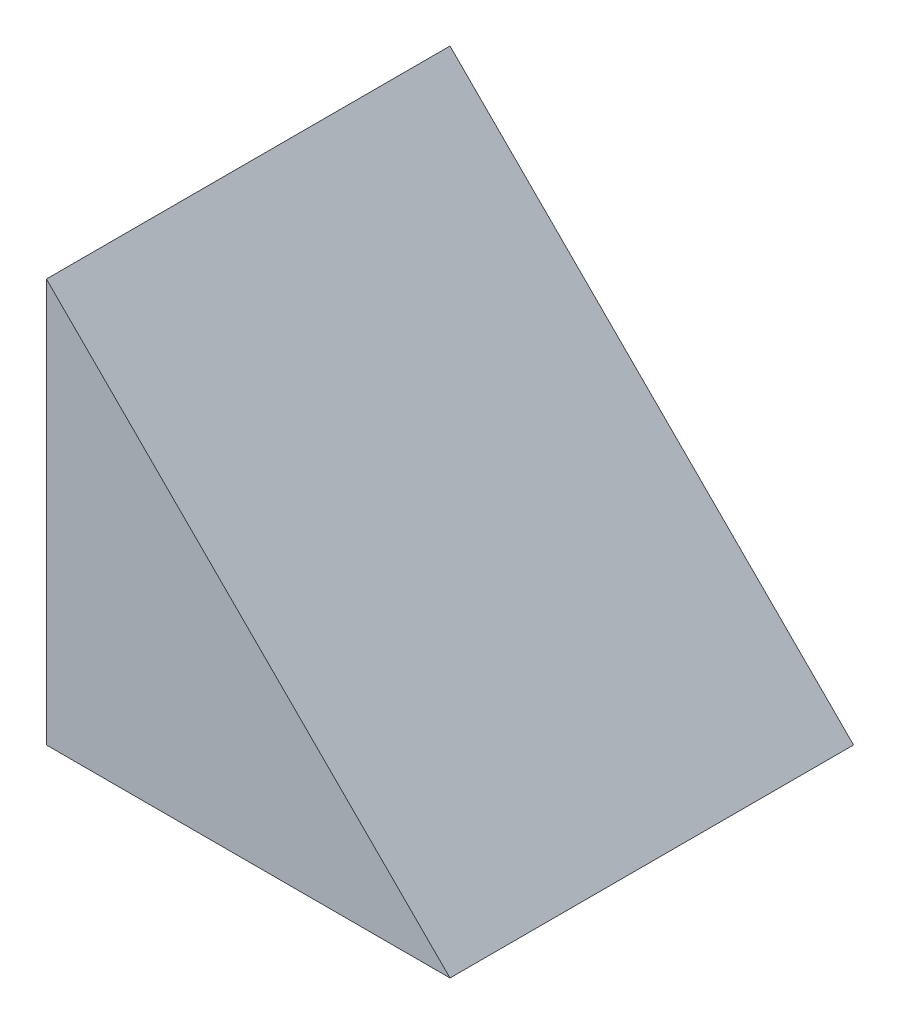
from build123d import *

# Parameters (mm, degrees)
BOSS_EXTRUDE1_DEPTH = 15


with BuildPart() as part:
    # Sketch1 → Boss-Extrude1 (new body)
    with BuildSketch(Plane.XY):
        Polygon((0, 0), (0, 15), (15, 0), align=None)
    extrude(amount=BOSS_EXTRUDE1_DEPTH)


solid = part.part
